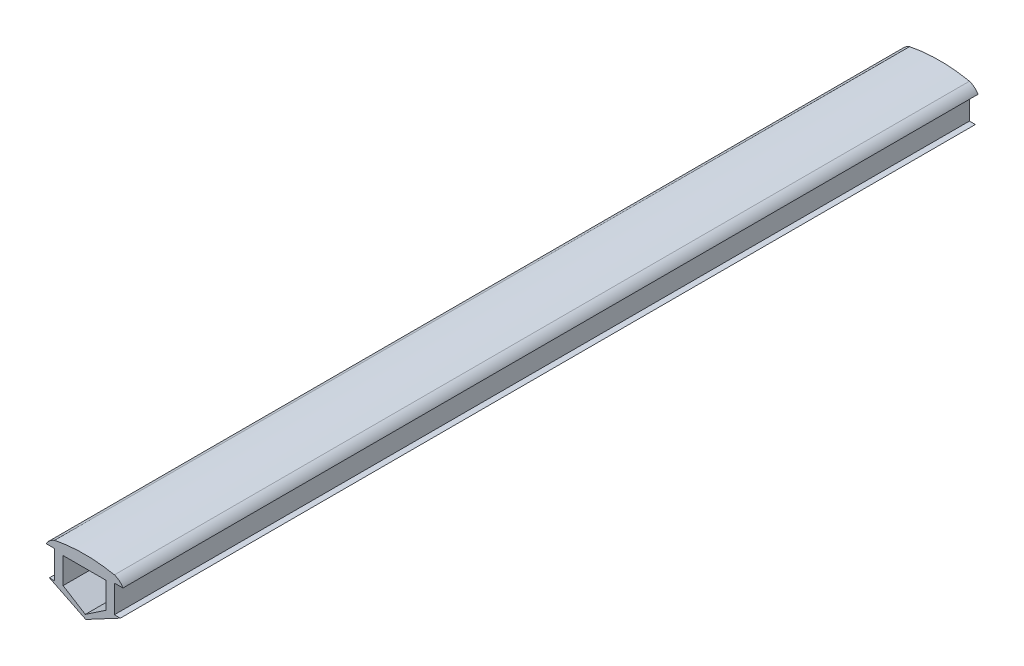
ISO-10303-21;
HEADER;
FILE_DESCRIPTION(('STEP AP214'),'2;1');
FILE_NAME('part.step','',(''),(''),'','','');
FILE_SCHEMA(('AUTOMOTIVE_DESIGN { 1 0 10303 214 1 1 1 1 }'));
ENDSEC;
DATA;
#1=APPLICATION_CONTEXT('core data for automotive mechanical design processes');
#2=APPLICATION_PROTOCOL_DEFINITION('international standard','automotive_design',2000,#1);
#3=PRODUCT_CONTEXT('',#1,'mechanical');
#4=PRODUCT('Part','Part','',(#3));
#5=PRODUCT_RELATED_PRODUCT_CATEGORY('part','',(#4));
#6=PRODUCT_DEFINITION_FORMATION('','',#4);
#7=PRODUCT_DEFINITION_CONTEXT('part definition',#1,'design');
#8=PRODUCT_DEFINITION('design','',#6,#7);
#9=PRODUCT_DEFINITION_SHAPE('','',#8);
#10=(LENGTH_UNIT() NAMED_UNIT(*) SI_UNIT(.MILLI.,.METRE.));
#11=(NAMED_UNIT(*) PLANE_ANGLE_UNIT() SI_UNIT($,.RADIAN.));
#12=(NAMED_UNIT(*) SI_UNIT($,.STERADIAN.) SOLID_ANGLE_UNIT());
#13=UNCERTAINTY_MEASURE_WITH_UNIT(LENGTH_MEASURE(1.E-05),#10,'distance_accuracy_value','');
#14=(GEOMETRIC_REPRESENTATION_CONTEXT(3) GLOBAL_UNCERTAINTY_ASSIGNED_CONTEXT((#13)) GLOBAL_UNIT_ASSIGNED_CONTEXT((#10,
#11,#12)) REPRESENTATION_CONTEXT('',''));
#15=CARTESIAN_POINT('',(0.,0.,0.));
#16=DIRECTION('',(0.,0.,1.));
#17=DIRECTION('',(1.,0.,0.));
#18=AXIS2_PLACEMENT_3D('',#15,#16,#17);
#19=CARTESIAN_POINT('',(-73.4205176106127,-3.51941436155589,150.));
#20=DIRECTION('',(0.,0.,-1.));
#21=DIRECTION('',(-1.,0.,0.));
#22=AXIS2_PLACEMENT_3D('',#19,#20,#21);
#23=PLANE('',#22);
#24=DIRECTION('',(0.,-1.,0.));
#25=VECTOR('',#24,1.);
#26=CARTESIAN_POINT('',(-74.5526172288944,-2.78540707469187,150.));
#27=LINE('',#26,#25);
#28=CARTESIAN_POINT('',(-74.5526172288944,-1.88139912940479,150.));
#29=VERTEX_POINT('',#28);
#30=CARTESIAN_POINT('',(-74.5526172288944,-6.78540707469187,150.));
#31=VERTEX_POINT('',#30);
#32=EDGE_CURVE('E191',#29,#31,#27,.T.);
#33=ORIENTED_EDGE('',*,*,#32,.T.);
#34=DIRECTION('',(-1.,0.,0.));
#35=VECTOR('',#34,1.);
#36=CARTESIAN_POINT('',(-74.5526172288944,-6.78540707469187,150.));
#37=LINE('',#36,#35);
#38=CARTESIAN_POINT('',(-75.4575170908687,-6.78540707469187,150.));
#39=VERTEX_POINT('',#38);
#40=EDGE_CURVE('E193',#31,#39,#37,.T.);
#41=ORIENTED_EDGE('',*,*,#40,.T.);
#42=DIRECTION('',(0.897744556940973,-0.440516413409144,0.));
#43=VECTOR('',#42,1.);
#44=CARTESIAN_POINT('',(-75.4575170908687,-6.78540707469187,150.));
#45=LINE('',#44,#43);
#46=CARTESIAN_POINT('',(-69.0717414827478,-9.91885850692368,150.));
#47=VERTEX_POINT('',#46);
#48=EDGE_CURVE('E196',#39,#47,#45,.T.);
#49=ORIENTED_EDGE('',*,*,#48,.T.);
#50=DIRECTION('',(0.882794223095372,0.469759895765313,0.));
#51=VECTOR('',#50,1.);
#52=CARTESIAN_POINT('',(-69.0717414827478,-9.91885850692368,150.));
#53=LINE('',#52,#51);
#54=CARTESIAN_POINT('',(-63.0133990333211,-6.69504230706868,150.));
#55=VERTEX_POINT('',#54);
#56=EDGE_CURVE('E198',#47,#55,#53,.T.);
#57=ORIENTED_EDGE('',*,*,#56,.T.);
#58=DIRECTION('',(-1.,0.,0.));
#59=VECTOR('',#58,1.);
#60=CARTESIAN_POINT('',(-63.0133990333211,-6.69504230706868,150.));
#61=LINE('',#60,#59);
#62=CARTESIAN_POINT('',(-64.0526172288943,-6.69504230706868,150.));
#63=VERTEX_POINT('',#62);
#64=EDGE_CURVE('E200',#55,#63,#61,.T.);
#65=ORIENTED_EDGE('',*,*,#64,.T.);
#66=DIRECTION('',(0.,1.,0.));
#67=VECTOR('',#66,1.);
#68=CARTESIAN_POINT('',(-64.0526172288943,-6.69504230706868,150.));
#69=LINE('',#68,#67);
#70=CARTESIAN_POINT('',(-64.0526172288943,-1.88139912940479,150.));
#71=VERTEX_POINT('',#70);
#72=EDGE_CURVE('E202',#63,#71,#69,.T.);
#73=ORIENTED_EDGE('',*,*,#72,.T.);
#74=DIRECTION('',(1.,0.,0.));
#75=VECTOR('',#74,1.);
#76=CARTESIAN_POINT('',(-64.0526172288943,-1.88139912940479,150.));
#77=LINE('',#76,#75);
#78=CARTESIAN_POINT('',(-62.5526172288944,-1.88139912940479,150.));
#79=VERTEX_POINT('',#78);
#80=EDGE_CURVE('E204',#71,#79,#77,.T.);
#81=ORIENTED_EDGE('',*,*,#80,.T.);
#82=CARTESIAN_POINT('',(-64.8813302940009,-3.15478269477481,150.));
#83=DIRECTION('',(0.,0.,1.));
#84=DIRECTION('',(-1.,0.,0.));
#85=AXIS2_PLACEMENT_3D('',#82,#83,#84);
#86=CIRCLE('',#85,2.65413078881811);
#87=CARTESIAN_POINT('',(-64.0526172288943,-0.633345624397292,150.));
#88=VERTEX_POINT('',#87);
#89=EDGE_CURVE('E206',#79,#88,#86,.T.);
#90=ORIENTED_EDGE('',*,*,#89,.T.);
#91=CARTESIAN_POINT('',(-69.3026172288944,-26.5373737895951,150.));
#92=DIRECTION('',(0.,0.,1.));
#93=DIRECTION('',(-1.,0.,0.));
#94=AXIS2_PLACEMENT_3D('',#91,#92,#93);
#95=CIRCLE('',#94,26.4306862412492);
#96=CARTESIAN_POINT('',(-74.5526172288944,-0.633345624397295,150.));
#97=VERTEX_POINT('',#96);
#98=EDGE_CURVE('E208',#88,#97,#95,.T.);
#99=ORIENTED_EDGE('',*,*,#98,.T.);
#100=CARTESIAN_POINT('',(-73.4205176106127,-3.51941436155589,150.));
#101=DIRECTION('',(0.,0.,1.));
#102=DIRECTION('',(-1.,0.,0.));
#103=AXIS2_PLACEMENT_3D('',#100,#101,#102);
#104=CIRCLE('',#103,3.10016810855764);
#105=CARTESIAN_POINT('',(-76.0526172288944,-1.88139912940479,150.));
#106=VERTEX_POINT('',#105);
#107=EDGE_CURVE('E210',#97,#106,#104,.T.);
#108=ORIENTED_EDGE('',*,*,#107,.T.);
#109=DIRECTION('',(1.,0.,0.));
#110=VECTOR('',#109,1.);
#111=CARTESIAN_POINT('',(-74.5526172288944,-1.88139912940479,150.));
#112=LINE('',#111,#110);
#113=EDGE_CURVE('E212',#106,#29,#112,.T.);
#114=ORIENTED_EDGE('',*,*,#113,.T.);
#115=EDGE_LOOP('',(#33,#41,#49,#57,#65,#73,#81,#90,#99,#108,#114));
#116=FACE_BOUND('',#115,.T.);
#117=DIRECTION('',(0.,-1.,0.));
#118=VECTOR('',#117,1.);
#119=CARTESIAN_POINT('',(-73.0526172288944,-6.77207647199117,150.));
#120=LINE('',#119,#118);
#121=CARTESIAN_POINT('',(-73.0526172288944,-2.19504230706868,150.));
#122=VERTEX_POINT('',#121);
#123=CARTESIAN_POINT('',(-73.0526172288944,-6.77207647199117,150.));
#124=VERTEX_POINT('',#123);
#125=EDGE_CURVE('E147',#122,#124,#120,.T.);
#126=ORIENTED_EDGE('',*,*,#125,.F.);
#127=DIRECTION('',(-1.,0.,0.));
#128=VECTOR('',#127,1.);
#129=CARTESIAN_POINT('',(-73.0526172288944,-2.19504230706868,150.));
#130=LINE('',#129,#128);
#131=CARTESIAN_POINT('',(-65.5526172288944,-2.19504230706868,150.));
#132=VERTEX_POINT('',#131);
#133=EDGE_CURVE('E174',#132,#122,#130,.T.);
#134=ORIENTED_EDGE('',*,*,#133,.F.);
#135=DIRECTION('',(0.,1.,0.));
#136=VECTOR('',#135,1.);
#137=CARTESIAN_POINT('',(-65.5526172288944,-2.19504230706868,150.));
#138=LINE('',#137,#136);
#139=CARTESIAN_POINT('',(-65.5526172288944,-6.77207647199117,150.));
#140=VERTEX_POINT('',#139);
#141=EDGE_CURVE('E170',#140,#132,#138,.T.);
#142=ORIENTED_EDGE('',*,*,#141,.F.);
#143=DIRECTION('',(0.829661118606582,0.558267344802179,0.));
#144=VECTOR('',#143,1.);
#145=CARTESIAN_POINT('',(-65.5526172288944,-6.77207647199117,150.));
#146=LINE('',#145,#144);
#147=CARTESIAN_POINT('',(-69.1534736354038,-9.19504230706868,150.));
#148=VERTEX_POINT('',#147);
#149=EDGE_CURVE('E168',#148,#140,#146,.T.);
#150=ORIENTED_EDGE('',*,*,#149,.F.);
#151=DIRECTION('',(0.849366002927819,-0.5278043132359,0.));
#152=VECTOR('',#151,1.);
#153=CARTESIAN_POINT('',(-69.1534736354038,-9.19504230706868,150.));
#154=LINE('',#153,#152);
#155=EDGE_CURVE('E155',#124,#148,#154,.T.);
#156=ORIENTED_EDGE('',*,*,#155,.F.);
#157=EDGE_LOOP('',(#126,#134,#142,#150,#156));
#158=FACE_BOUND('',#157,.T.);
#159=ADVANCED_FACE('F34',(#116,#158),#23,.F.);
#160=CARTESIAN_POINT('',(-73.4205176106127,-3.51941436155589,0.));
#161=DIRECTION('',(0.,0.,-1.));
#162=DIRECTION('',(-1.,0.,0.));
#163=AXIS2_PLACEMENT_3D('',#160,#161,#162);
#164=PLANE('',#163);
#165=DIRECTION('',(0.,-1.,0.));
#166=VECTOR('',#165,1.);
#167=CARTESIAN_POINT('',(-74.5526172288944,-2.78540707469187,0.));
#168=LINE('',#167,#166);
#169=CARTESIAN_POINT('',(-74.5526172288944,-1.88139912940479,0.));
#170=VERTEX_POINT('',#169);
#171=CARTESIAN_POINT('',(-74.5526172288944,-6.78540707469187,0.));
#172=VERTEX_POINT('',#171);
#173=EDGE_CURVE('E163',#170,#172,#168,.T.);
#174=ORIENTED_EDGE('',*,*,#173,.F.);
#175=DIRECTION('',(1.,0.,0.));
#176=VECTOR('',#175,1.);
#177=CARTESIAN_POINT('',(-74.5526172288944,-1.88139912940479,0.));
#178=LINE('',#177,#176);
#179=CARTESIAN_POINT('',(-76.0526172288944,-1.88139912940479,0.));
#180=VERTEX_POINT('',#179);
#181=EDGE_CURVE('E194',#180,#170,#178,.T.);
#182=ORIENTED_EDGE('',*,*,#181,.F.);
#183=CARTESIAN_POINT('',(-73.4205176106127,-3.51941436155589,0.));
#184=DIRECTION('',(0.,0.,1.));
#185=DIRECTION('',(-1.,0.,0.));
#186=AXIS2_PLACEMENT_3D('',#183,#184,#185);
#187=CIRCLE('',#186,3.10016810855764);
#188=CARTESIAN_POINT('',(-74.5526172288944,-0.633345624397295,0.));
#189=VERTEX_POINT('',#188);
#190=EDGE_CURVE('E233',#189,#180,#187,.T.);
#191=ORIENTED_EDGE('',*,*,#190,.F.);
#192=CARTESIAN_POINT('',(-69.3026172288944,-26.5373737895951,0.));
#193=DIRECTION('',(0.,0.,1.));
#194=DIRECTION('',(-1.,0.,0.));
#195=AXIS2_PLACEMENT_3D('',#192,#193,#194);
#196=CIRCLE('',#195,26.4306862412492);
#197=CARTESIAN_POINT('',(-64.0526172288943,-0.633345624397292,0.));
#198=VERTEX_POINT('',#197);
#199=EDGE_CURVE('E231',#198,#189,#196,.T.);
#200=ORIENTED_EDGE('',*,*,#199,.F.);
#201=CARTESIAN_POINT('',(-64.8813302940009,-3.15478269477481,0.));
#202=DIRECTION('',(0.,0.,1.));
#203=DIRECTION('',(-1.,0.,0.));
#204=AXIS2_PLACEMENT_3D('',#201,#202,#203);
#205=CIRCLE('',#204,2.65413078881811);
#206=CARTESIAN_POINT('',(-62.5526172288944,-1.88139912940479,0.));
#207=VERTEX_POINT('',#206);
#208=EDGE_CURVE('E229',#207,#198,#205,.T.);
#209=ORIENTED_EDGE('',*,*,#208,.F.);
#210=DIRECTION('',(1.,0.,0.));
#211=VECTOR('',#210,1.);
#212=CARTESIAN_POINT('',(-64.0526172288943,-1.88139912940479,0.));
#213=LINE('',#212,#211);
#214=CARTESIAN_POINT('',(-64.0526172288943,-1.88139912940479,0.));
#215=VERTEX_POINT('',#214);
#216=EDGE_CURVE('E227',#215,#207,#213,.T.);
#217=ORIENTED_EDGE('',*,*,#216,.F.);
#218=DIRECTION('',(0.,1.,0.));
#219=VECTOR('',#218,1.);
#220=CARTESIAN_POINT('',(-64.0526172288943,-2.69504230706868,0.));
#221=LINE('',#220,#219);
#222=CARTESIAN_POINT('',(-64.0526172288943,-6.69504230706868,0.));
#223=VERTEX_POINT('',#222);
#224=EDGE_CURVE('E225',#223,#215,#221,.T.);
#225=ORIENTED_EDGE('',*,*,#224,.F.);
#226=DIRECTION('',(-1.,0.,0.));
#227=VECTOR('',#226,1.);
#228=CARTESIAN_POINT('',(-63.0133990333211,-6.69504230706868,0.));
#229=LINE('',#228,#227);
#230=CARTESIAN_POINT('',(-63.0133990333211,-6.69504230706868,0.));
#231=VERTEX_POINT('',#230);
#232=EDGE_CURVE('E222',#231,#223,#229,.T.);
#233=ORIENTED_EDGE('',*,*,#232,.F.);
#234=DIRECTION('',(0.882794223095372,0.469759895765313,0.));
#235=VECTOR('',#234,1.);
#236=CARTESIAN_POINT('',(-69.0717414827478,-9.91885850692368,0.));
#237=LINE('',#236,#235);
#238=CARTESIAN_POINT('',(-69.0717414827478,-9.91885850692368,0.));
#239=VERTEX_POINT('',#238);
#240=EDGE_CURVE('E220',#239,#231,#237,.T.);
#241=ORIENTED_EDGE('',*,*,#240,.F.);
#242=DIRECTION('',(0.897744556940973,-0.440516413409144,0.));
#243=VECTOR('',#242,1.);
#244=CARTESIAN_POINT('',(-75.4575170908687,-6.78540707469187,0.));
#245=LINE('',#244,#243);
#246=CARTESIAN_POINT('',(-75.4575170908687,-6.78540707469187,0.));
#247=VERTEX_POINT('',#246);
#248=EDGE_CURVE('E218',#247,#239,#245,.T.);
#249=ORIENTED_EDGE('',*,*,#248,.F.);
#250=DIRECTION('',(-1.,0.,0.));
#251=VECTOR('',#250,1.);
#252=CARTESIAN_POINT('',(-74.5526172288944,-6.78540707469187,0.));
#253=LINE('',#252,#251);
#254=EDGE_CURVE('E216',#172,#247,#253,.T.);
#255=ORIENTED_EDGE('',*,*,#254,.F.);
#256=EDGE_LOOP('',(#174,#182,#191,#200,#209,#217,#225,#233,#241,#249,#255));
#257=FACE_BOUND('',#256,.T.);
#258=DIRECTION('',(-1.,0.,0.));
#259=VECTOR('',#258,1.);
#260=CARTESIAN_POINT('',(-73.0526172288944,-2.19504230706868,0.));
#261=LINE('',#260,#259);
#262=CARTESIAN_POINT('',(-65.5526172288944,-2.19504230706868,0.));
#263=VERTEX_POINT('',#262);
#264=CARTESIAN_POINT('',(-73.0526172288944,-2.19504230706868,0.));
#265=VERTEX_POINT('',#264);
#266=EDGE_CURVE('E156',#263,#265,#261,.T.);
#267=ORIENTED_EDGE('',*,*,#266,.T.);
#268=DIRECTION('',(0.,-1.,0.));
#269=VECTOR('',#268,1.);
#270=CARTESIAN_POINT('',(-73.0526172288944,-6.77207647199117,0.));
#271=LINE('',#270,#269);
#272=CARTESIAN_POINT('',(-73.0526172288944,-6.77207647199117,0.));
#273=VERTEX_POINT('',#272);
#274=EDGE_CURVE('E57',#265,#273,#271,.T.);
#275=ORIENTED_EDGE('',*,*,#274,.T.);
#276=DIRECTION('',(0.849366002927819,-0.5278043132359,0.));
#277=VECTOR('',#276,1.);
#278=CARTESIAN_POINT('',(-69.1534736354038,-9.19504230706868,0.));
#279=LINE('',#278,#277);
#280=CARTESIAN_POINT('',(-69.1534736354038,-9.19504230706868,0.));
#281=VERTEX_POINT('',#280);
#282=EDGE_CURVE('E162',#273,#281,#279,.T.);
#283=ORIENTED_EDGE('',*,*,#282,.T.);
#284=DIRECTION('',(0.829661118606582,0.558267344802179,0.));
#285=VECTOR('',#284,1.);
#286=CARTESIAN_POINT('',(-65.5526172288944,-6.77207647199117,0.));
#287=LINE('',#286,#285);
#288=CARTESIAN_POINT('',(-65.5526172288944,-6.77207647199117,0.));
#289=VERTEX_POINT('',#288);
#290=EDGE_CURVE('E178',#281,#289,#287,.T.);
#291=ORIENTED_EDGE('',*,*,#290,.T.);
#292=DIRECTION('',(0.,1.,0.));
#293=VECTOR('',#292,1.);
#294=CARTESIAN_POINT('',(-65.5526172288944,-2.19504230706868,0.));
#295=LINE('',#294,#293);
#296=EDGE_CURVE('E181',#289,#263,#295,.T.);
#297=ORIENTED_EDGE('',*,*,#296,.T.);
#298=EDGE_LOOP('',(#267,#275,#283,#291,#297));
#299=FACE_BOUND('',#298,.T.);
#300=ADVANCED_FACE('F274',(#257,#299),#164,.T.);
#301=CARTESIAN_POINT('',(-74.5526172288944,-2.78540707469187,150.));
#302=DIRECTION('',(1.,0.,0.));
#303=DIRECTION('',(0.,0.,-1.));
#304=AXIS2_PLACEMENT_3D('',#301,#302,#303);
#305=PLANE('',#304);
#306=ORIENTED_EDGE('',*,*,#173,.T.);
#307=DIRECTION('',(0.,0.,-1.));
#308=VECTOR('',#307,1.);
#309=CARTESIAN_POINT('',(-74.5526172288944,-6.78540707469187,150.));
#310=LINE('',#309,#308);
#311=EDGE_CURVE('E11',#31,#172,#310,.T.);
#312=ORIENTED_EDGE('',*,*,#311,.F.);
#313=ORIENTED_EDGE('',*,*,#32,.F.);
#314=DIRECTION('',(0.,0.,-1.));
#315=VECTOR('',#314,1.);
#316=CARTESIAN_POINT('',(-74.5526172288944,-1.88139912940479,150.));
#317=LINE('',#316,#315);
#318=EDGE_CURVE('E214',#29,#170,#317,.T.);
#319=ORIENTED_EDGE('',*,*,#318,.T.);
#320=EDGE_LOOP('',(#306,#312,#313,#319));
#321=FACE_BOUND('',#320,.T.);
#322=ADVANCED_FACE('F36',(#321),#305,.F.);
#323=CARTESIAN_POINT('',(-74.5526172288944,-6.78540707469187,150.));
#324=DIRECTION('',(0.,-1.,0.));
#325=DIRECTION('',(0.,0.,-1.));
#326=AXIS2_PLACEMENT_3D('',#323,#324,#325);
#327=PLANE('',#326);
#328=ORIENTED_EDGE('',*,*,#254,.T.);
#329=DIRECTION('',(0.,0.,-1.));
#330=VECTOR('',#329,1.);
#331=CARTESIAN_POINT('',(-75.4575170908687,-6.78540707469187,150.));
#332=LINE('',#331,#330);
#333=EDGE_CURVE('E42',#39,#247,#332,.T.);
#334=ORIENTED_EDGE('',*,*,#333,.F.);
#335=ORIENTED_EDGE('',*,*,#40,.F.);
#336=ORIENTED_EDGE('',*,*,#311,.T.);
#337=EDGE_LOOP('',(#328,#334,#335,#336));
#338=FACE_BOUND('',#337,.T.);
#339=ADVANCED_FACE('F290',(#338),#327,.F.);
#340=CARTESIAN_POINT('',(-75.4575170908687,-6.78540707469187,150.));
#341=DIRECTION('',(0.440516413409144,0.897744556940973,0.));
#342=DIRECTION('',(-0.897744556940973,0.440516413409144,0.));
#343=AXIS2_PLACEMENT_3D('',#340,#341,#342);
#344=PLANE('',#343);
#345=ORIENTED_EDGE('',*,*,#248,.T.);
#346=DIRECTION('',(0.,0.,-1.));
#347=VECTOR('',#346,1.);
#348=CARTESIAN_POINT('',(-69.0717414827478,-9.91885850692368,150.));
#349=LINE('',#348,#347);
#350=EDGE_CURVE('E260',#47,#239,#349,.T.);
#351=ORIENTED_EDGE('',*,*,#350,.F.);
#352=ORIENTED_EDGE('',*,*,#48,.F.);
#353=ORIENTED_EDGE('',*,*,#333,.T.);
#354=EDGE_LOOP('',(#345,#351,#352,#353));
#355=FACE_BOUND('',#354,.T.);
#356=ADVANCED_FACE('F267',(#355),#344,.F.);
#357=CARTESIAN_POINT('',(-69.0717414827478,-9.91885850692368,150.));
#358=DIRECTION('',(-0.469759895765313,0.882794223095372,0.));
#359=DIRECTION('',(-0.882794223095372,-0.469759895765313,0.));
#360=AXIS2_PLACEMENT_3D('',#357,#358,#359);
#361=PLANE('',#360);
#362=ORIENTED_EDGE('',*,*,#240,.T.);
#363=DIRECTION('',(0.,0.,-1.));
#364=VECTOR('',#363,1.);
#365=CARTESIAN_POINT('',(-63.0133990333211,-6.69504230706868,150.));
#366=LINE('',#365,#364);
#367=EDGE_CURVE('E257',#55,#231,#366,.T.);
#368=ORIENTED_EDGE('',*,*,#367,.F.);
#369=ORIENTED_EDGE('',*,*,#56,.F.);
#370=ORIENTED_EDGE('',*,*,#350,.T.);
#371=EDGE_LOOP('',(#362,#368,#369,#370));
#372=FACE_BOUND('',#371,.T.);
#373=ADVANCED_FACE('F279',(#372),#361,.F.);
#374=CARTESIAN_POINT('',(-63.0133990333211,-6.69504230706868,150.));
#375=DIRECTION('',(0.,-1.,0.));
#376=DIRECTION('',(0.,0.,-1.));
#377=AXIS2_PLACEMENT_3D('',#374,#375,#376);
#378=PLANE('',#377);
#379=ORIENTED_EDGE('',*,*,#232,.T.);
#380=DIRECTION('',(0.,0.,-1.));
#381=VECTOR('',#380,1.);
#382=CARTESIAN_POINT('',(-64.0526172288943,-6.69504230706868,150.));
#383=LINE('',#382,#381);
#384=EDGE_CURVE('E254',#63,#223,#383,.T.);
#385=ORIENTED_EDGE('',*,*,#384,.F.);
#386=ORIENTED_EDGE('',*,*,#64,.F.);
#387=ORIENTED_EDGE('',*,*,#367,.T.);
#388=EDGE_LOOP('',(#379,#385,#386,#387));
#389=FACE_BOUND('',#388,.T.);
#390=ADVANCED_FACE('F283',(#389),#378,.F.);
#391=CARTESIAN_POINT('',(-64.0526172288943,-2.69504230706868,150.));
#392=DIRECTION('',(-1.,0.,0.));
#393=DIRECTION('',(0.,0.,1.));
#394=AXIS2_PLACEMENT_3D('',#391,#392,#393);
#395=PLANE('',#394);
#396=ORIENTED_EDGE('',*,*,#224,.T.);
#397=DIRECTION('',(0.,0.,-1.));
#398=VECTOR('',#397,1.);
#399=CARTESIAN_POINT('',(-64.0526172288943,-1.88139912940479,150.));
#400=LINE('',#399,#398);
#401=EDGE_CURVE('E251',#71,#215,#400,.T.);
#402=ORIENTED_EDGE('',*,*,#401,.F.);
#403=ORIENTED_EDGE('',*,*,#72,.F.);
#404=ORIENTED_EDGE('',*,*,#384,.T.);
#405=EDGE_LOOP('',(#396,#402,#403,#404));
#406=FACE_BOUND('',#405,.T.);
#407=ADVANCED_FACE('F318',(#406),#395,.F.);
#408=CARTESIAN_POINT('',(-64.0526172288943,-1.88139912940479,150.));
#409=DIRECTION('',(0.,1.,0.));
#410=DIRECTION('',(0.,0.,1.));
#411=AXIS2_PLACEMENT_3D('',#408,#409,#410);
#412=PLANE('',#411);
#413=ORIENTED_EDGE('',*,*,#216,.T.);
#414=DIRECTION('',(0.,0.,-1.));
#415=VECTOR('',#414,1.);
#416=CARTESIAN_POINT('',(-62.5526172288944,-1.88139912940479,150.));
#417=LINE('',#416,#415);
#418=EDGE_CURVE('E248',#79,#207,#417,.T.);
#419=ORIENTED_EDGE('',*,*,#418,.F.);
#420=ORIENTED_EDGE('',*,*,#80,.F.);
#421=ORIENTED_EDGE('',*,*,#401,.T.);
#422=EDGE_LOOP('',(#413,#419,#420,#421));
#423=FACE_BOUND('',#422,.T.);
#424=ADVANCED_FACE('F316',(#423),#412,.F.);
#425=CARTESIAN_POINT('',(-64.8813302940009,-3.15478269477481,150.));
#426=DIRECTION('',(0.,0.,-1.));
#427=DIRECTION('',(-1.,0.,0.));
#428=AXIS2_PLACEMENT_3D('',#425,#426,#427);
#429=CYLINDRICAL_SURFACE('',#428,2.65413078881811);
#430=ORIENTED_EDGE('',*,*,#208,.T.);
#431=DIRECTION('',(0.,0.,-1.));
#432=VECTOR('',#431,1.);
#433=CARTESIAN_POINT('',(-64.0526172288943,-0.633345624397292,150.));
#434=LINE('',#433,#432);
#435=EDGE_CURVE('E245',#88,#198,#434,.T.);
#436=ORIENTED_EDGE('',*,*,#435,.F.);
#437=ORIENTED_EDGE('',*,*,#89,.F.);
#438=ORIENTED_EDGE('',*,*,#418,.T.);
#439=EDGE_LOOP('',(#430,#436,#437,#438));
#440=FACE_BOUND('',#439,.T.);
#441=ADVANCED_FACE('F312',(#440),#429,.T.);
#442=CARTESIAN_POINT('',(-69.3026172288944,-26.5373737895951,150.));
#443=DIRECTION('',(0.,0.,-1.));
#444=DIRECTION('',(-1.,0.,0.));
#445=AXIS2_PLACEMENT_3D('',#442,#443,#444);
#446=CYLINDRICAL_SURFACE('',#445,26.4306862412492);
#447=ORIENTED_EDGE('',*,*,#199,.T.);
#448=DIRECTION('',(0.,0.,-1.));
#449=VECTOR('',#448,1.);
#450=CARTESIAN_POINT('',(-74.5526172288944,-0.633345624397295,150.));
#451=LINE('',#450,#449);
#452=EDGE_CURVE('E242',#97,#189,#451,.T.);
#453=ORIENTED_EDGE('',*,*,#452,.F.);
#454=ORIENTED_EDGE('',*,*,#98,.F.);
#455=ORIENTED_EDGE('',*,*,#435,.T.);
#456=EDGE_LOOP('',(#447,#453,#454,#455));
#457=FACE_BOUND('',#456,.T.);
#458=ADVANCED_FACE('F307',(#457),#446,.T.);
#459=CARTESIAN_POINT('',(-73.4205176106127,-3.51941436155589,150.));
#460=DIRECTION('',(0.,0.,-1.));
#461=DIRECTION('',(-1.,0.,0.));
#462=AXIS2_PLACEMENT_3D('',#459,#460,#461);
#463=CYLINDRICAL_SURFACE('',#462,3.10016810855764);
#464=ORIENTED_EDGE('',*,*,#190,.T.);
#465=DIRECTION('',(0.,0.,-1.));
#466=VECTOR('',#465,1.);
#467=CARTESIAN_POINT('',(-76.0526172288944,-1.88139912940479,150.));
#468=LINE('',#467,#466);
#469=EDGE_CURVE('E239',#106,#180,#468,.T.);
#470=ORIENTED_EDGE('',*,*,#469,.F.);
#471=ORIENTED_EDGE('',*,*,#107,.F.);
#472=ORIENTED_EDGE('',*,*,#452,.T.);
#473=EDGE_LOOP('',(#464,#470,#471,#472));
#474=FACE_BOUND('',#473,.T.);
#475=ADVANCED_FACE('F301',(#474),#463,.T.);
#476=CARTESIAN_POINT('',(-74.5526172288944,-1.88139912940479,150.));
#477=DIRECTION('',(0.,1.,0.));
#478=DIRECTION('',(-1.,0.,0.));
#479=AXIS2_PLACEMENT_3D('',#476,#477,#478);
#480=PLANE('',#479);
#481=ORIENTED_EDGE('',*,*,#181,.T.);
#482=ORIENTED_EDGE('',*,*,#318,.F.);
#483=ORIENTED_EDGE('',*,*,#113,.F.);
#484=ORIENTED_EDGE('',*,*,#469,.T.);
#485=EDGE_LOOP('',(#481,#482,#483,#484));
#486=FACE_BOUND('',#485,.T.);
#487=ADVANCED_FACE('F296',(#486),#480,.F.);
#488=CARTESIAN_POINT('',(-73.0526172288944,-6.77207647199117,150.));
#489=DIRECTION('',(1.,0.,0.));
#490=DIRECTION('',(0.,0.,-1.));
#491=AXIS2_PLACEMENT_3D('',#488,#489,#490);
#492=PLANE('',#491);
#493=ORIENTED_EDGE('',*,*,#274,.F.);
#494=DIRECTION('',(0.,0.,-1.));
#495=VECTOR('',#494,1.);
#496=CARTESIAN_POINT('',(-73.0526172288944,-2.19504230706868,150.));
#497=LINE('',#496,#495);
#498=EDGE_CURVE('E151',#122,#265,#497,.T.);
#499=ORIENTED_EDGE('',*,*,#498,.F.);
#500=ORIENTED_EDGE('',*,*,#125,.T.);
#501=DIRECTION('',(0.,0.,-1.));
#502=VECTOR('',#501,1.);
#503=CARTESIAN_POINT('',(-73.0526172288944,-6.77207647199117,150.));
#504=LINE('',#503,#502);
#505=EDGE_CURVE('E150',#124,#273,#504,.T.);
#506=ORIENTED_EDGE('',*,*,#505,.T.);
#507=EDGE_LOOP('',(#493,#499,#500,#506));
#508=FACE_BOUND('',#507,.T.);
#509=ADVANCED_FACE('F149',(#508),#492,.T.);
#510=CARTESIAN_POINT('',(-69.1534736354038,-9.19504230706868,150.));
#511=DIRECTION('',(0.5278043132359,0.849366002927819,0.));
#512=DIRECTION('',(-0.849366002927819,0.5278043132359,0.));
#513=AXIS2_PLACEMENT_3D('',#510,#511,#512);
#514=PLANE('',#513);
#515=ORIENTED_EDGE('',*,*,#282,.F.);
#516=ORIENTED_EDGE('',*,*,#505,.F.);
#517=ORIENTED_EDGE('',*,*,#155,.T.);
#518=DIRECTION('',(0.,0.,-1.));
#519=VECTOR('',#518,1.);
#520=CARTESIAN_POINT('',(-69.1534736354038,-9.19504230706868,150.));
#521=LINE('',#520,#519);
#522=EDGE_CURVE('E164',#148,#281,#521,.T.);
#523=ORIENTED_EDGE('',*,*,#522,.T.);
#524=EDGE_LOOP('',(#515,#516,#517,#523));
#525=FACE_BOUND('',#524,.T.);
#526=ADVANCED_FACE('F159',(#525),#514,.T.);
#527=CARTESIAN_POINT('',(-65.5526172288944,-6.77207647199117,150.));
#528=DIRECTION('',(-0.558267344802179,0.829661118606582,0.));
#529=DIRECTION('',(-0.829661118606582,-0.558267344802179,0.));
#530=AXIS2_PLACEMENT_3D('',#527,#528,#529);
#531=PLANE('',#530);
#532=ORIENTED_EDGE('',*,*,#290,.F.);
#533=ORIENTED_EDGE('',*,*,#522,.F.);
#534=ORIENTED_EDGE('',*,*,#149,.T.);
#535=DIRECTION('',(0.,0.,-1.));
#536=VECTOR('',#535,1.);
#537=CARTESIAN_POINT('',(-65.5526172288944,-6.77207647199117,150.));
#538=LINE('',#537,#536);
#539=EDGE_CURVE('E188',#140,#289,#538,.T.);
#540=ORIENTED_EDGE('',*,*,#539,.T.);
#541=EDGE_LOOP('',(#532,#533,#534,#540));
#542=FACE_BOUND('',#541,.T.);
#543=ADVANCED_FACE('F370',(#542),#531,.T.);
#544=CARTESIAN_POINT('',(-65.5526172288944,-2.19504230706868,150.));
#545=DIRECTION('',(-1.,0.,0.));
#546=DIRECTION('',(0.,0.,1.));
#547=AXIS2_PLACEMENT_3D('',#544,#545,#546);
#548=PLANE('',#547);
#549=ORIENTED_EDGE('',*,*,#296,.F.);
#550=ORIENTED_EDGE('',*,*,#539,.F.);
#551=ORIENTED_EDGE('',*,*,#141,.T.);
#552=DIRECTION('',(0.,0.,-1.));
#553=VECTOR('',#552,1.);
#554=CARTESIAN_POINT('',(-65.5526172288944,-2.19504230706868,150.));
#555=LINE('',#554,#553);
#556=EDGE_CURVE('E49',#132,#263,#555,.T.);
#557=ORIENTED_EDGE('',*,*,#556,.T.);
#558=EDGE_LOOP('',(#549,#550,#551,#557));
#559=FACE_BOUND('',#558,.T.);
#560=ADVANCED_FACE('F376',(#559),#548,.T.);
#561=CARTESIAN_POINT('',(-73.0526172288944,-2.19504230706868,150.));
#562=DIRECTION('',(0.,-1.,0.));
#563=DIRECTION('',(0.,0.,-1.));
#564=AXIS2_PLACEMENT_3D('',#561,#562,#563);
#565=PLANE('',#564);
#566=ORIENTED_EDGE('',*,*,#266,.F.);
#567=ORIENTED_EDGE('',*,*,#556,.F.);
#568=ORIENTED_EDGE('',*,*,#133,.T.);
#569=ORIENTED_EDGE('',*,*,#498,.T.);
#570=EDGE_LOOP('',(#566,#567,#568,#569));
#571=FACE_BOUND('',#570,.T.);
#572=ADVANCED_FACE('F384',(#571),#565,.T.);
#573=CLOSED_SHELL('',(#159,#300,#322,#339,#356,#373,#390,#407,#424,#441,#458,#475,#487,#509,
#526,#543,#560,#572));
#574=MANIFOLD_SOLID_BREP('B2',#573);
#575=ADVANCED_BREP_SHAPE_REPRESENTATION('',(#18,#574),#14);
#576=SHAPE_DEFINITION_REPRESENTATION(#9,#575);
ENDSEC;
END-ISO-10303-21;
